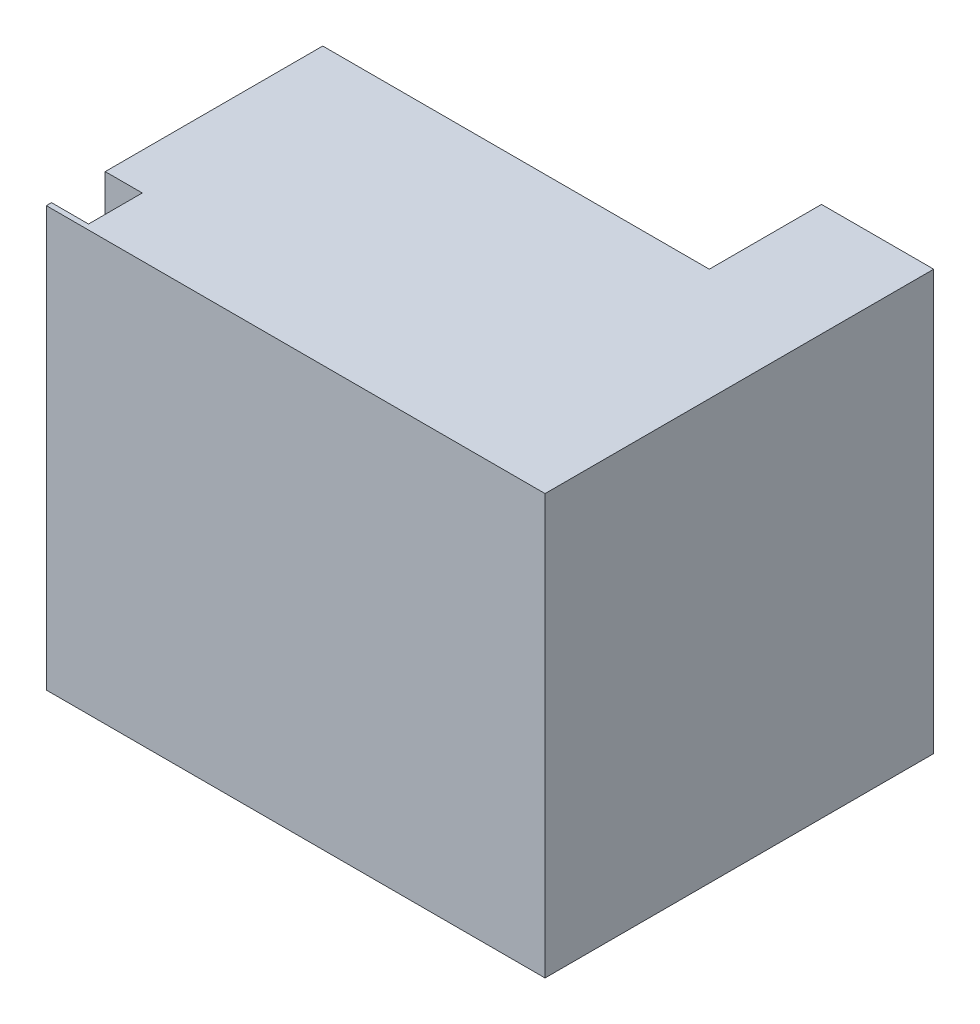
ISO-10303-21;
HEADER;
FILE_DESCRIPTION(('STEP AP214'),'2;1');
FILE_NAME('part.step','',(''),(''),'','','');
FILE_SCHEMA(('AUTOMOTIVE_DESIGN { 1 0 10303 214 1 1 1 1 }'));
ENDSEC;
DATA;
#1=APPLICATION_CONTEXT('core data for automotive mechanical design processes');
#2=APPLICATION_PROTOCOL_DEFINITION('international standard','automotive_design',2000,#1);
#3=PRODUCT_CONTEXT('',#1,'mechanical');
#4=PRODUCT('Part','Part','',(#3));
#5=PRODUCT_RELATED_PRODUCT_CATEGORY('part','',(#4));
#6=PRODUCT_DEFINITION_FORMATION('','',#4);
#7=PRODUCT_DEFINITION_CONTEXT('part definition',#1,'design');
#8=PRODUCT_DEFINITION('design','',#6,#7);
#9=PRODUCT_DEFINITION_SHAPE('','',#8);
#10=(LENGTH_UNIT() NAMED_UNIT(*) SI_UNIT(.MILLI.,.METRE.));
#11=(NAMED_UNIT(*) PLANE_ANGLE_UNIT() SI_UNIT($,.RADIAN.));
#12=(NAMED_UNIT(*) SI_UNIT($,.STERADIAN.) SOLID_ANGLE_UNIT());
#13=UNCERTAINTY_MEASURE_WITH_UNIT(LENGTH_MEASURE(1.E-05),#10,'distance_accuracy_value','');
#14=(GEOMETRIC_REPRESENTATION_CONTEXT(3) GLOBAL_UNCERTAINTY_ASSIGNED_CONTEXT((#13)) GLOBAL_UNIT_ASSIGNED_CONTEXT((#10,
#11,#12)) REPRESENTATION_CONTEXT('',''));
#15=CARTESIAN_POINT('',(0.,0.,0.));
#16=DIRECTION('',(0.,0.,1.));
#17=DIRECTION('',(1.,0.,0.));
#18=AXIS2_PLACEMENT_3D('',#15,#16,#17);
#19=CARTESIAN_POINT('',(8.24749999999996,18.2999999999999,16.5701));
#20=DIRECTION('',(1.,0.,0.));
#21=DIRECTION('',(0.,0.,-1.));
#22=AXIS2_PLACEMENT_3D('',#19,#20,#21);
#23=PLANE('',#22);
#24=DIRECTION('',(0.,1.,0.));
#25=VECTOR('',#24,1.);
#26=CARTESIAN_POINT('',(8.24749999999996,18.2999999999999,14.0701));
#27=LINE('',#26,#25);
#28=CARTESIAN_POINT('',(8.24749999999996,27.6472,14.0701));
#29=VERTEX_POINT('',#28);
#30=CARTESIAN_POINT('',(8.24749999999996,8.95279999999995,14.0701));
#31=VERTEX_POINT('',#30);
#32=EDGE_CURVE('E166',#29,#31,#27,.F.);
#33=ORIENTED_EDGE('',*,*,#32,.T.);
#34=DIRECTION('',(0.,0.,1.));
#35=VECTOR('',#34,1.);
#36=CARTESIAN_POINT('',(8.24749999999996,8.95279999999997,25.2296));
#37=LINE('',#36,#35);
#38=CARTESIAN_POINT('',(8.24749999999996,8.95279999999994,19.0700999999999));
#39=VERTEX_POINT('',#38);
#40=EDGE_CURVE('E152',#31,#39,#37,.T.);
#41=ORIENTED_EDGE('',*,*,#40,.T.);
#42=DIRECTION('',(0.,1.,0.));
#43=VECTOR('',#42,1.);
#44=CARTESIAN_POINT('',(8.24749999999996,18.3,19.0700999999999));
#45=LINE('',#44,#43);
#46=CARTESIAN_POINT('',(8.24749999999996,27.6472,19.0700999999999));
#47=VERTEX_POINT('',#46);
#48=EDGE_CURVE('E128',#47,#39,#45,.F.);
#49=ORIENTED_EDGE('',*,*,#48,.F.);
#50=DIRECTION('',(0.,0.,-1.));
#51=VECTOR('',#50,1.);
#52=CARTESIAN_POINT('',(8.24749999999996,27.6472,25.2296));
#53=LINE('',#52,#51);
#54=EDGE_CURVE('E134',#47,#29,#53,.T.);
#55=ORIENTED_EDGE('',*,*,#54,.T.);
#56=EDGE_LOOP('',(#33,#41,#49,#55));
#57=FACE_BOUND('',#56,.T.);
#58=ADVANCED_FACE('F16',(#57),#23,.F.);
#59=CARTESIAN_POINT('',(10.7475,18.2999999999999,14.0701));
#60=DIRECTION('',(0.,0.,1.));
#61=DIRECTION('',(1.,0.,0.));
#62=AXIS2_PLACEMENT_3D('',#59,#60,#61);
#63=PLANE('',#62);
#64=DIRECTION('',(1.,0.,0.));
#65=VECTOR('',#64,1.);
#66=CARTESIAN_POINT('',(22.7725,8.95279999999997,14.0701));
#67=LINE('',#66,#65);
#68=CARTESIAN_POINT('',(13.2475,8.95279999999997,14.0701));
#69=VERTEX_POINT('',#68);
#70=EDGE_CURVE('E143',#69,#31,#67,.F.);
#71=ORIENTED_EDGE('',*,*,#70,.T.);
#72=ORIENTED_EDGE('',*,*,#32,.F.);
#73=DIRECTION('',(1.,0.,0.));
#74=VECTOR('',#73,1.);
#75=CARTESIAN_POINT('',(22.7725,27.6472,14.0701));
#76=LINE('',#75,#74);
#77=CARTESIAN_POINT('',(13.2475,27.6472,14.0701));
#78=VERTEX_POINT('',#77);
#79=EDGE_CURVE('E137',#29,#78,#76,.T.);
#80=ORIENTED_EDGE('',*,*,#79,.T.);
#81=DIRECTION('',(0.,1.,0.));
#82=VECTOR('',#81,1.);
#83=CARTESIAN_POINT('',(13.2475,18.3,14.0701));
#84=LINE('',#83,#82);
#85=EDGE_CURVE('E102',#78,#69,#84,.F.);
#86=ORIENTED_EDGE('',*,*,#85,.T.);
#87=EDGE_LOOP('',(#71,#72,#80,#86));
#88=FACE_BOUND('',#87,.T.);
#89=ADVANCED_FACE('F441',(#88),#63,.F.);
#90=CARTESIAN_POINT('',(13.2475,18.3,25.2296));
#91=DIRECTION('',(-1.,0.,0.));
#92=DIRECTION('',(0.,0.,1.));
#93=AXIS2_PLACEMENT_3D('',#90,#91,#92);
#94=PLANE('',#93);
#95=ORIENTED_EDGE('',*,*,#85,.F.);
#96=DIRECTION('',(0.,0.,-1.));
#97=VECTOR('',#96,1.);
#98=CARTESIAN_POINT('',(13.2475,27.6472,25.2296));
#99=LINE('',#98,#97);
#100=CARTESIAN_POINT('',(13.2475,27.6472,31.3891));
#101=VERTEX_POINT('',#100);
#102=EDGE_CURVE('E146',#78,#101,#99,.F.);
#103=ORIENTED_EDGE('',*,*,#102,.T.);
#104=DIRECTION('',(0.,1.,0.));
#105=VECTOR('',#104,1.);
#106=CARTESIAN_POINT('',(13.2475,18.3,31.3891));
#107=LINE('',#106,#105);
#108=CARTESIAN_POINT('',(13.2475,8.95279999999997,31.3891));
#109=VERTEX_POINT('',#108);
#110=EDGE_CURVE('E109',#101,#109,#107,.F.);
#111=ORIENTED_EDGE('',*,*,#110,.T.);
#112=DIRECTION('',(0.,0.,1.));
#113=VECTOR('',#112,1.);
#114=CARTESIAN_POINT('',(13.2475,8.95279999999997,25.2296));
#115=LINE('',#114,#113);
#116=EDGE_CURVE('E131',#109,#69,#115,.F.);
#117=ORIENTED_EDGE('',*,*,#116,.T.);
#118=EDGE_LOOP('',(#95,#103,#111,#117));
#119=FACE_BOUND('',#118,.T.);
#120=ADVANCED_FACE('F452',(#119),#94,.F.);
#121=CARTESIAN_POINT('',(-7.32649999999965,25.31421,29.9603499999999));
#122=DIRECTION('',(1.,0.,0.));
#123=DIRECTION('',(0.,0.,-1.));
#124=AXIS2_PLACEMENT_3D('',#121,#122,#123);
#125=PLANE('',#124);
#126=DIRECTION('',(0.,1.,0.));
#127=VECTOR('',#126,1.);
#128=CARTESIAN_POINT('',(-7.32649999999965,27.6472,28.76274));
#129=LINE('',#128,#127);
#130=CARTESIAN_POINT('',(-7.32649999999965,27.6472,28.76274));
#131=VERTEX_POINT('',#130);
#132=CARTESIAN_POINT('',(-7.32649999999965,22.9812200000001,28.76274));
#133=VERTEX_POINT('',#132);
#134=EDGE_CURVE('E96',#131,#133,#129,.F.);
#135=ORIENTED_EDGE('',*,*,#134,.T.);
#136=CARTESIAN_POINT('',(-7.32649999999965,22.9812200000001,29.9603499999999));
#137=DIRECTION('',(1.,0.,0.));
#138=DIRECTION('',(0.,0.,-1.));
#139=AXIS2_PLACEMENT_3D('',#136,#137,#138);
#140=CIRCLE('',#139,1.19761000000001);
#141=CARTESIAN_POINT('',(-7.32649999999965,22.9812200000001,31.1579599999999));
#142=VERTEX_POINT('',#141);
#143=EDGE_CURVE('E20',#133,#142,#140,.F.);
#144=ORIENTED_EDGE('',*,*,#143,.T.);
#145=DIRECTION('',(0.,1.,0.));
#146=VECTOR('',#145,1.);
#147=CARTESIAN_POINT('',(-7.32649999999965,22.9812200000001,31.1579599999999));
#148=LINE('',#147,#146);
#149=CARTESIAN_POINT('',(-7.32649999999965,27.6472,31.1579599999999));
#150=VERTEX_POINT('',#149);
#151=EDGE_CURVE('E94',#142,#150,#148,.T.);
#152=ORIENTED_EDGE('',*,*,#151,.T.);
#153=DIRECTION('',(0.,0.,-1.));
#154=VECTOR('',#153,1.);
#155=CARTESIAN_POINT('',(-7.32649999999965,27.6472,25.2296));
#156=LINE('',#155,#154);
#157=EDGE_CURVE('E123',#150,#131,#156,.T.);
#158=ORIENTED_EDGE('',*,*,#157,.T.);
#159=EDGE_LOOP('',(#135,#144,#152,#158));
#160=FACE_BOUND('',#159,.T.);
#161=ADVANCED_FACE('F93',(#160),#125,.F.);
#162=CARTESIAN_POINT('',(-4.15150000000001,18.3,21.26085));
#163=DIRECTION('',(-1.,0.,0.));
#164=DIRECTION('',(0.,0.,1.));
#165=AXIS2_PLACEMENT_3D('',#162,#163,#164);
#166=PLANE('',#165);
#167=CARTESIAN_POINT('',(-4.15150000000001,18.3,21.26085));
#168=DIRECTION('',(-1.,0.,0.));
#169=DIRECTION('',(0.,0.,1.));
#170=AXIS2_PLACEMENT_3D('',#167,#168,#169);
#171=CIRCLE('',#170,1.19761);
#172=CARTESIAN_POINT('',(-4.15150000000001,18.3,22.45846));
#173=VERTEX_POINT('',#172);
#174=EDGE_CURVE('E120',#173,#173,#171,.T.);
#175=ORIENTED_EDGE('',*,*,#174,.T.);
#176=EDGE_LOOP('',(#175));
#177=FACE_BOUND('',#176,.T.);
#178=ADVANCED_FACE('F200',(#177),#166,.T.);
#179=CARTESIAN_POINT('',(-2.6275,24.8070181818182,25.2296));
#180=DIRECTION('',(-1.,0.,0.));
#181=DIRECTION('',(0.,0.,1.));
#182=AXIS2_PLACEMENT_3D('',#179,#180,#181);
#183=PLANE('',#182);
#184=CARTESIAN_POINT('',(-2.6275,24.6499999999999,25.2295999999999));
#185=DIRECTION('',(-1.,0.,0.));
#186=DIRECTION('',(0.,0.,1.));
#187=AXIS2_PLACEMENT_3D('',#184,#185,#186);
#188=CIRCLE('',#187,1.7272);
#189=CARTESIAN_POINT('',(-2.6275,24.6499999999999,26.9567999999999));
#190=VERTEX_POINT('',#189);
#191=EDGE_CURVE('E195',#190,#190,#188,.T.);
#192=ORIENTED_EDGE('',*,*,#191,.T.);
#193=EDGE_LOOP('',(#192));
#194=FACE_BOUND('',#193,.T.);
#195=ADVANCED_FACE('F313',(#194),#183,.T.);
#196=CARTESIAN_POINT('',(-2.6275,12.1070181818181,25.2296));
#197=DIRECTION('',(-1.,0.,0.));
#198=DIRECTION('',(0.,0.,1.));
#199=AXIS2_PLACEMENT_3D('',#196,#197,#198);
#200=PLANE('',#199);
#201=CARTESIAN_POINT('',(-2.6275,11.95,25.2295999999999));
#202=DIRECTION('',(-1.,0.,0.));
#203=DIRECTION('',(0.,0.,1.));
#204=AXIS2_PLACEMENT_3D('',#201,#202,#203);
#205=CIRCLE('',#204,1.7272);
#206=CARTESIAN_POINT('',(-2.6275,11.95,26.9567999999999));
#207=VERTEX_POINT('',#206);
#208=EDGE_CURVE('E192',#207,#207,#205,.T.);
#209=ORIENTED_EDGE('',*,*,#208,.T.);
#210=EDGE_LOOP('',(#209));
#211=FACE_BOUND('',#210,.T.);
#212=ADVANCED_FACE('F315',(#211),#200,.T.);
#213=CARTESIAN_POINT('',(-8.9775,22.9812200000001,29.9603499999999));
#214=DIRECTION('',(1.,0.,0.));
#215=DIRECTION('',(0.,0.,-1.));
#216=AXIS2_PLACEMENT_3D('',#213,#214,#215);
#217=CYLINDRICAL_SURFACE('',#216,1.19761000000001);
#218=CARTESIAN_POINT('',(-8.9775,22.9812200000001,29.9603499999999));
#219=DIRECTION('',(1.,0.,0.));
#220=DIRECTION('',(0.,0.,-1.));
#221=AXIS2_PLACEMENT_3D('',#218,#219,#220);
#222=CIRCLE('',#221,1.19761000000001);
#223=CARTESIAN_POINT('',(-8.9775,22.9812200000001,28.76274));
#224=VERTEX_POINT('',#223);
#225=CARTESIAN_POINT('',(-8.9775,22.9812200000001,31.1579599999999));
#226=VERTEX_POINT('',#225);
#227=EDGE_CURVE('E113',#224,#226,#222,.F.);
#228=ORIENTED_EDGE('',*,*,#227,.T.);
#229=DIRECTION('',(1.,0.,0.));
#230=VECTOR('',#229,1.);
#231=CARTESIAN_POINT('',(-8.9775,22.9812200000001,31.1579599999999));
#232=LINE('',#231,#230);
#233=EDGE_CURVE('E101',#226,#142,#232,.T.);
#234=ORIENTED_EDGE('',*,*,#233,.T.);
#235=ORIENTED_EDGE('',*,*,#143,.F.);
#236=DIRECTION('',(-1.,0.,0.));
#237=VECTOR('',#236,1.);
#238=CARTESIAN_POINT('',(-8.9775,22.9812200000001,28.76274));
#239=LINE('',#238,#237);
#240=EDGE_CURVE('E149',#133,#224,#239,.T.);
#241=ORIENTED_EDGE('',*,*,#240,.T.);
#242=EDGE_LOOP('',(#228,#234,#235,#241));
#243=FACE_BOUND('',#242,.T.);
#244=ADVANCED_FACE('F112',(#243),#217,.F.);
#245=CARTESIAN_POINT('',(-8.9775,22.9812200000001,31.1579599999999));
#246=DIRECTION('',(0.,0.,1.));
#247=DIRECTION('',(1.,0.,0.));
#248=AXIS2_PLACEMENT_3D('',#245,#246,#247);
#249=PLANE('',#248);
#250=ORIENTED_EDGE('',*,*,#233,.F.);
#251=DIRECTION('',(0.,1.,0.));
#252=VECTOR('',#251,1.);
#253=CARTESIAN_POINT('',(-8.9775,18.3,31.1579599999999));
#254=LINE('',#253,#252);
#255=CARTESIAN_POINT('',(-8.9775,27.6472,31.1579599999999));
#256=VERTEX_POINT('',#255);
#257=EDGE_CURVE('E191',#226,#256,#254,.T.);
#258=ORIENTED_EDGE('',*,*,#257,.T.);
#259=DIRECTION('',(1.,0.,0.));
#260=VECTOR('',#259,1.);
#261=CARTESIAN_POINT('',(22.7725,27.6472,31.15796));
#262=LINE('',#261,#260);
#263=EDGE_CURVE('E108',#256,#150,#262,.T.);
#264=ORIENTED_EDGE('',*,*,#263,.T.);
#265=ORIENTED_EDGE('',*,*,#151,.F.);
#266=EDGE_LOOP('',(#250,#258,#264,#265));
#267=FACE_BOUND('',#266,.T.);
#268=ADVANCED_FACE('F105',(#267),#249,.F.);
#269=CARTESIAN_POINT('',(22.7725,18.3,31.3891));
#270=DIRECTION('',(0.,0.,-1.));
#271=DIRECTION('',(-1.,0.,0.));
#272=AXIS2_PLACEMENT_3D('',#269,#270,#271);
#273=PLANE('',#272);
#274=DIRECTION('',(1.,0.,0.));
#275=VECTOR('',#274,1.);
#276=CARTESIAN_POINT('',(22.7725,27.6472,31.3891));
#277=LINE('',#276,#275);
#278=CARTESIAN_POINT('',(-8.9775,27.6472,31.3891));
#279=VERTEX_POINT('',#278);
#280=EDGE_CURVE('E240',#101,#279,#277,.F.);
#281=ORIENTED_EDGE('',*,*,#280,.T.);
#282=DIRECTION('',(0.,1.,0.));
#283=VECTOR('',#282,1.);
#284=CARTESIAN_POINT('',(-8.9775,18.3,31.3891));
#285=LINE('',#284,#283);
#286=CARTESIAN_POINT('',(-8.9775,8.95279999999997,31.3891));
#287=VERTEX_POINT('',#286);
#288=EDGE_CURVE('E231',#279,#287,#285,.F.);
#289=ORIENTED_EDGE('',*,*,#288,.T.);
#290=DIRECTION('',(1.,0.,0.));
#291=VECTOR('',#290,1.);
#292=CARTESIAN_POINT('',(22.7725,8.95279999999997,31.3891));
#293=LINE('',#292,#291);
#294=EDGE_CURVE('E155',#287,#109,#293,.T.);
#295=ORIENTED_EDGE('',*,*,#294,.T.);
#296=ORIENTED_EDGE('',*,*,#110,.F.);
#297=EDGE_LOOP('',(#281,#289,#295,#296));
#298=FACE_BOUND('',#297,.T.);
#299=ADVANCED_FACE('F263',(#298),#273,.F.);
#300=CARTESIAN_POINT('',(22.7725,8.95279999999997,25.2296));
#301=DIRECTION('',(0.,1.,0.));
#302=DIRECTION('',(0.,0.,1.));
#303=AXIS2_PLACEMENT_3D('',#300,#301,#302);
#304=PLANE('',#303);
#305=ORIENTED_EDGE('',*,*,#294,.F.);
#306=DIRECTION('',(0.,0.,-1.));
#307=VECTOR('',#306,1.);
#308=CARTESIAN_POINT('',(-8.9775,8.95279999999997,25.2296));
#309=LINE('',#308,#307);
#310=CARTESIAN_POINT('',(-8.9775,8.95279999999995,19.0701));
#311=VERTEX_POINT('',#310);
#312=EDGE_CURVE('E229',#287,#311,#309,.T.);
#313=ORIENTED_EDGE('',*,*,#312,.T.);
#314=DIRECTION('',(-1.,0.,0.));
#315=VECTOR('',#314,1.);
#316=CARTESIAN_POINT('',(22.7725,8.95279999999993,19.0700999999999));
#317=LINE('',#316,#315);
#318=EDGE_CURVE('E130',#39,#311,#317,.T.);
#319=ORIENTED_EDGE('',*,*,#318,.F.);
#320=ORIENTED_EDGE('',*,*,#40,.F.);
#321=ORIENTED_EDGE('',*,*,#70,.F.);
#322=ORIENTED_EDGE('',*,*,#116,.F.);
#323=EDGE_LOOP('',(#305,#313,#319,#320,#321,#322));
#324=FACE_BOUND('',#323,.T.);
#325=ADVANCED_FACE('F332',(#324),#304,.F.);
#326=CARTESIAN_POINT('',(22.7725,18.3,19.0700999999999));
#327=DIRECTION('',(0.,0.,-1.));
#328=DIRECTION('',(-1.,0.,0.));
#329=AXIS2_PLACEMENT_3D('',#326,#327,#328);
#330=PLANE('',#329);
#331=DIRECTION('',(0.,1.,0.));
#332=VECTOR('',#331,1.);
#333=CARTESIAN_POINT('',(-8.9775,18.3,19.0701));
#334=LINE('',#333,#332);
#335=CARTESIAN_POINT('',(-8.9775,27.6472,19.0701));
#336=VERTEX_POINT('',#335);
#337=EDGE_CURVE('E221',#311,#336,#334,.T.);
#338=ORIENTED_EDGE('',*,*,#337,.T.);
#339=DIRECTION('',(1.,0.,0.));
#340=VECTOR('',#339,1.);
#341=CARTESIAN_POINT('',(22.7725,27.6472,19.0700999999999));
#342=LINE('',#341,#340);
#343=EDGE_CURVE('E125',#336,#47,#342,.T.);
#344=ORIENTED_EDGE('',*,*,#343,.T.);
#345=ORIENTED_EDGE('',*,*,#48,.T.);
#346=ORIENTED_EDGE('',*,*,#318,.T.);
#347=EDGE_LOOP('',(#338,#344,#345,#346));
#348=FACE_BOUND('',#347,.T.);
#349=ADVANCED_FACE('F227',(#348),#330,.T.);
#350=CARTESIAN_POINT('',(22.7725,27.6472,25.2296));
#351=DIRECTION('',(0.,-1.,0.));
#352=DIRECTION('',(0.,0.,-1.));
#353=AXIS2_PLACEMENT_3D('',#350,#351,#352);
#354=PLANE('',#353);
#355=ORIENTED_EDGE('',*,*,#79,.F.);
#356=ORIENTED_EDGE('',*,*,#54,.F.);
#357=ORIENTED_EDGE('',*,*,#343,.F.);
#358=DIRECTION('',(0.,0.,-1.));
#359=VECTOR('',#358,1.);
#360=CARTESIAN_POINT('',(-8.9775,27.6472,25.2296));
#361=LINE('',#360,#359);
#362=CARTESIAN_POINT('',(-8.9775,27.6472,28.76274));
#363=VERTEX_POINT('',#362);
#364=EDGE_CURVE('E218',#336,#363,#361,.F.);
#365=ORIENTED_EDGE('',*,*,#364,.T.);
#366=DIRECTION('',(-1.,0.,0.));
#367=VECTOR('',#366,1.);
#368=CARTESIAN_POINT('',(-8.9775,27.6472,28.76274));
#369=LINE('',#368,#367);
#370=EDGE_CURVE('E35',#363,#131,#369,.F.);
#371=ORIENTED_EDGE('',*,*,#370,.T.);
#372=ORIENTED_EDGE('',*,*,#157,.F.);
#373=ORIENTED_EDGE('',*,*,#263,.F.);
#374=DIRECTION('',(0.,0.,-1.));
#375=VECTOR('',#374,1.);
#376=CARTESIAN_POINT('',(-8.9775,27.6472,25.2296));
#377=LINE('',#376,#375);
#378=EDGE_CURVE('E251',#256,#279,#377,.F.);
#379=ORIENTED_EDGE('',*,*,#378,.T.);
#380=ORIENTED_EDGE('',*,*,#280,.F.);
#381=ORIENTED_EDGE('',*,*,#102,.F.);
#382=EDGE_LOOP('',(#355,#356,#357,#365,#371,#372,#373,#379,#380,#381));
#383=FACE_BOUND('',#382,.T.);
#384=ADVANCED_FACE('F267',(#383),#354,.F.);
#385=CARTESIAN_POINT('',(-8.9775,27.6472,28.76274));
#386=DIRECTION('',(0.,0.,-1.));
#387=DIRECTION('',(-1.,0.,0.));
#388=AXIS2_PLACEMENT_3D('',#385,#386,#387);
#389=PLANE('',#388);
#390=ORIENTED_EDGE('',*,*,#370,.F.);
#391=DIRECTION('',(0.,1.,0.));
#392=VECTOR('',#391,1.);
#393=CARTESIAN_POINT('',(-8.9775,18.3,28.76274));
#394=LINE('',#393,#392);
#395=EDGE_CURVE('E189',#363,#224,#394,.F.);
#396=ORIENTED_EDGE('',*,*,#395,.T.);
#397=ORIENTED_EDGE('',*,*,#240,.F.);
#398=ORIENTED_EDGE('',*,*,#134,.F.);
#399=EDGE_LOOP('',(#390,#396,#397,#398));
#400=FACE_BOUND('',#399,.T.);
#401=ADVANCED_FACE('F206',(#400),#389,.F.);
#402=CARTESIAN_POINT('',(-4.15150000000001,18.3,21.26085));
#403=DIRECTION('',(-1.,0.,0.));
#404=DIRECTION('',(0.,0.,1.));
#405=AXIS2_PLACEMENT_3D('',#402,#403,#404);
#406=CYLINDRICAL_SURFACE('',#405,1.19761);
#407=ORIENTED_EDGE('',*,*,#174,.F.);
#408=EDGE_LOOP('',(#407));
#409=FACE_BOUND('',#408,.T.);
#410=CARTESIAN_POINT('',(-8.9775,18.3,21.26085));
#411=DIRECTION('',(-1.,0.,0.));
#412=DIRECTION('',(0.,0.,1.));
#413=AXIS2_PLACEMENT_3D('',#410,#411,#412);
#414=CIRCLE('',#413,1.19761);
#415=CARTESIAN_POINT('',(-8.9775,18.3,22.45846));
#416=VERTEX_POINT('',#415);
#417=EDGE_CURVE('E186',#416,#416,#414,.T.);
#418=ORIENTED_EDGE('',*,*,#417,.T.);
#419=EDGE_LOOP('',(#418));
#420=FACE_BOUND('',#419,.T.);
#421=ADVANCED_FACE('F202',(#409,#420),#406,.F.);
#422=CARTESIAN_POINT('',(-2.6275,24.6499999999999,25.2295999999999));
#423=DIRECTION('',(-1.,0.,0.));
#424=DIRECTION('',(0.,0.,1.));
#425=AXIS2_PLACEMENT_3D('',#422,#423,#424);
#426=CYLINDRICAL_SURFACE('',#425,1.7272);
#427=ORIENTED_EDGE('',*,*,#191,.F.);
#428=EDGE_LOOP('',(#427));
#429=FACE_BOUND('',#428,.T.);
#430=CARTESIAN_POINT('',(-8.9775,24.6499999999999,25.2295999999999));
#431=DIRECTION('',(-1.,0.,0.));
#432=DIRECTION('',(0.,0.,1.));
#433=AXIS2_PLACEMENT_3D('',#430,#431,#432);
#434=CIRCLE('',#433,1.7272);
#435=CARTESIAN_POINT('',(-8.9775,24.6499999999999,26.9567999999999));
#436=VERTEX_POINT('',#435);
#437=EDGE_CURVE('E183',#436,#436,#434,.T.);
#438=ORIENTED_EDGE('',*,*,#437,.T.);
#439=EDGE_LOOP('',(#438));
#440=FACE_BOUND('',#439,.T.);
#441=ADVANCED_FACE('F205',(#429,#440),#426,.F.);
#442=CARTESIAN_POINT('',(-2.6275,11.95,25.2295999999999));
#443=DIRECTION('',(-1.,0.,0.));
#444=DIRECTION('',(0.,0.,1.));
#445=AXIS2_PLACEMENT_3D('',#442,#443,#444);
#446=CYLINDRICAL_SURFACE('',#445,1.7272);
#447=ORIENTED_EDGE('',*,*,#208,.F.);
#448=EDGE_LOOP('',(#447));
#449=FACE_BOUND('',#448,.T.);
#450=CARTESIAN_POINT('',(-8.9775,11.95,25.2295999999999));
#451=DIRECTION('',(-1.,0.,0.));
#452=DIRECTION('',(0.,0.,1.));
#453=AXIS2_PLACEMENT_3D('',#450,#451,#452);
#454=CIRCLE('',#453,1.7272);
#455=CARTESIAN_POINT('',(-8.9775,11.95,26.9567999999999));
#456=VERTEX_POINT('',#455);
#457=EDGE_CURVE('E180',#456,#456,#454,.T.);
#458=ORIENTED_EDGE('',*,*,#457,.T.);
#459=EDGE_LOOP('',(#458));
#460=FACE_BOUND('',#459,.T.);
#461=ADVANCED_FACE('F296',(#449,#460),#446,.F.);
#462=CARTESIAN_POINT('',(-4.15150000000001,18.3,29.1983499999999));
#463=DIRECTION('',(-1.,0.,0.));
#464=DIRECTION('',(0.,0.,1.));
#465=AXIS2_PLACEMENT_3D('',#462,#463,#464);
#466=PLANE('',#465);
#467=CARTESIAN_POINT('',(-4.15150000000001,18.3,29.1983499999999));
#468=DIRECTION('',(-1.,0.,0.));
#469=DIRECTION('',(0.,0.,1.));
#470=AXIS2_PLACEMENT_3D('',#467,#468,#469);
#471=CIRCLE('',#470,1.19761);
#472=CARTESIAN_POINT('',(-4.15150000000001,18.3,30.3959599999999));
#473=VERTEX_POINT('',#472);
#474=EDGE_CURVE('E26',#473,#473,#471,.T.);
#475=ORIENTED_EDGE('',*,*,#474,.T.);
#476=EDGE_LOOP('',(#475));
#477=FACE_BOUND('',#476,.T.);
#478=ADVANCED_FACE('F213',(#477),#466,.T.);
#479=CARTESIAN_POINT('',(-8.9775,18.3,25.2296));
#480=DIRECTION('',(1.,0.,0.));
#481=DIRECTION('',(0.,0.,-1.));
#482=AXIS2_PLACEMENT_3D('',#479,#480,#481);
#483=PLANE('',#482);
#484=CARTESIAN_POINT('',(-8.9775,18.3,29.1983499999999));
#485=DIRECTION('',(-1.,0.,0.));
#486=DIRECTION('',(0.,0.,1.));
#487=AXIS2_PLACEMENT_3D('',#484,#485,#486);
#488=CIRCLE('',#487,1.19761);
#489=CARTESIAN_POINT('',(-8.9775,18.3,30.3959599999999));
#490=VERTEX_POINT('',#489);
#491=EDGE_CURVE('E11',#490,#490,#488,.F.);
#492=ORIENTED_EDGE('',*,*,#491,.T.);
#493=EDGE_LOOP('',(#492));
#494=FACE_BOUND('',#493,.T.);
#495=ORIENTED_EDGE('',*,*,#457,.F.);
#496=EDGE_LOOP('',(#495));
#497=FACE_BOUND('',#496,.T.);
#498=ORIENTED_EDGE('',*,*,#437,.F.);
#499=EDGE_LOOP('',(#498));
#500=FACE_BOUND('',#499,.T.);
#501=ORIENTED_EDGE('',*,*,#417,.F.);
#502=EDGE_LOOP('',(#501));
#503=FACE_BOUND('',#502,.T.);
#504=ORIENTED_EDGE('',*,*,#364,.F.);
#505=ORIENTED_EDGE('',*,*,#337,.F.);
#506=ORIENTED_EDGE('',*,*,#312,.F.);
#507=ORIENTED_EDGE('',*,*,#288,.F.);
#508=ORIENTED_EDGE('',*,*,#378,.F.);
#509=ORIENTED_EDGE('',*,*,#257,.F.);
#510=ORIENTED_EDGE('',*,*,#227,.F.);
#511=ORIENTED_EDGE('',*,*,#395,.F.);
#512=EDGE_LOOP('',(#504,#505,#506,#507,#508,#509,#510,#511));
#513=FACE_BOUND('',#512,.T.);
#514=ADVANCED_FACE('F210',(#494,#497,#500,#503,#513),#483,.F.);
#515=CARTESIAN_POINT('',(-4.15150000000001,18.3,29.1983499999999));
#516=DIRECTION('',(-1.,0.,0.));
#517=DIRECTION('',(0.,0.,1.));
#518=AXIS2_PLACEMENT_3D('',#515,#516,#517);
#519=CYLINDRICAL_SURFACE('',#518,1.19761);
#520=ORIENTED_EDGE('',*,*,#491,.F.);
#521=EDGE_LOOP('',(#520));
#522=FACE_BOUND('',#521,.T.);
#523=ORIENTED_EDGE('',*,*,#474,.F.);
#524=EDGE_LOOP('',(#523));
#525=FACE_BOUND('',#524,.T.);
#526=ADVANCED_FACE('F18',(#522,#525),#519,.F.);
#527=CLOSED_SHELL('',(#58,#89,#120,#161,#178,#195,#212,#244,#268,#299,#325,#349,#384,#401,#421,
#441,#461,#478,#514,#526));
#528=MANIFOLD_SOLID_BREP('B1',#527);
#529=ADVANCED_BREP_SHAPE_REPRESENTATION('',(#18,#528),#14);
#530=SHAPE_DEFINITION_REPRESENTATION(#9,#529);
ENDSEC;
END-ISO-10303-21;
